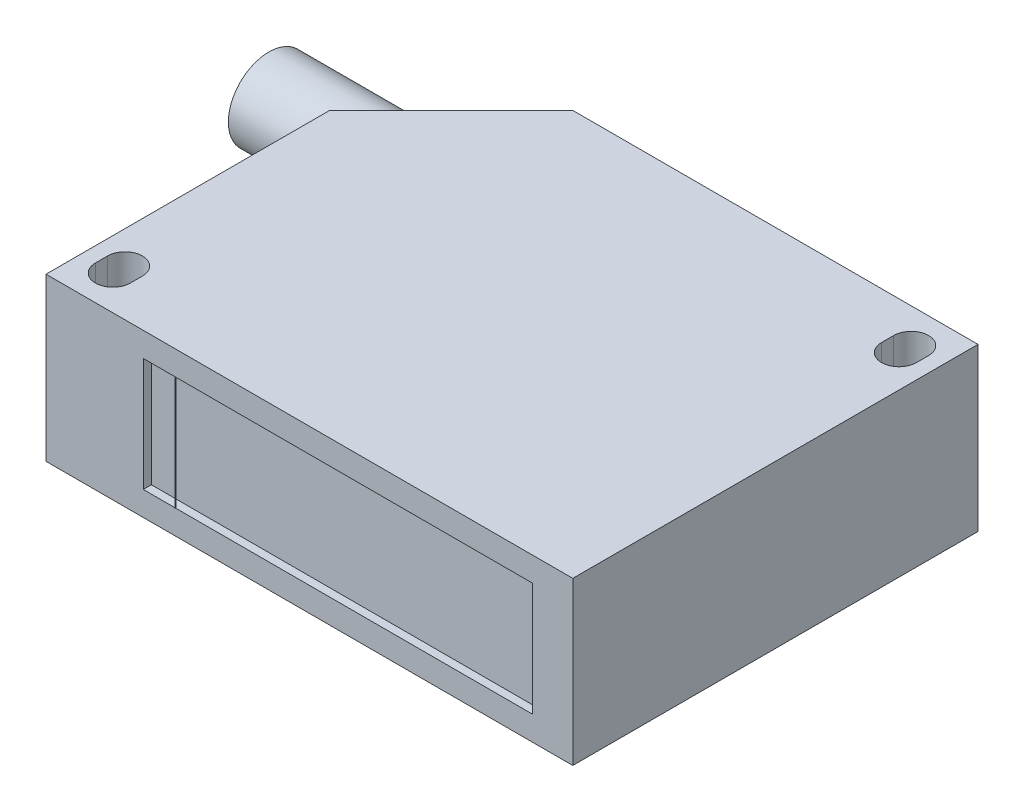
ISO-10303-21;
HEADER;
FILE_DESCRIPTION(('STEP AP214'),'2;1');
FILE_NAME('part.step','',(''),(''),'','','');
FILE_SCHEMA(('AUTOMOTIVE_DESIGN { 1 0 10303 214 1 1 1 1 }'));
ENDSEC;
DATA;
#1=APPLICATION_CONTEXT('core data for automotive mechanical design processes');
#2=APPLICATION_PROTOCOL_DEFINITION('international standard','automotive_design',2000,#1);
#3=PRODUCT_CONTEXT('',#1,'mechanical');
#4=PRODUCT('Part','Part','',(#3));
#5=PRODUCT_RELATED_PRODUCT_CATEGORY('part','',(#4));
#6=PRODUCT_DEFINITION_FORMATION('','',#4);
#7=PRODUCT_DEFINITION_CONTEXT('part definition',#1,'design');
#8=PRODUCT_DEFINITION('design','',#6,#7);
#9=PRODUCT_DEFINITION_SHAPE('','',#8);
#10=(LENGTH_UNIT() NAMED_UNIT(*) SI_UNIT(.MILLI.,.METRE.));
#11=(NAMED_UNIT(*) PLANE_ANGLE_UNIT() SI_UNIT($,.RADIAN.));
#12=(NAMED_UNIT(*) SI_UNIT($,.STERADIAN.) SOLID_ANGLE_UNIT());
#13=UNCERTAINTY_MEASURE_WITH_UNIT(LENGTH_MEASURE(1.E-05),#10,'distance_accuracy_value','');
#14=(GEOMETRIC_REPRESENTATION_CONTEXT(3) GLOBAL_UNCERTAINTY_ASSIGNED_CONTEXT((#13)) GLOBAL_UNIT_ASSIGNED_CONTEXT((#10,
#11,#12)) REPRESENTATION_CONTEXT('',''));
#15=CARTESIAN_POINT('',(0.,0.,0.));
#16=DIRECTION('',(0.,0.,1.));
#17=DIRECTION('',(1.,0.,0.));
#18=AXIS2_PLACEMENT_3D('',#15,#16,#17);
#19=CARTESIAN_POINT('',(-16.5,7.,25.1));
#20=DIRECTION('',(1.,0.,0.));
#21=DIRECTION('',(0.,0.,-1.));
#22=AXIS2_PLACEMENT_3D('',#19,#20,#21);
#23=PLANE('',#22);
#24=DIRECTION('',(0.,-1.,0.));
#25=VECTOR('',#24,1.);
#26=CARTESIAN_POINT('',(-16.5,7.,25.));
#27=LINE('',#26,#25);
#28=CARTESIAN_POINT('',(-16.5,7.,25.));
#29=VERTEX_POINT('',#28);
#30=CARTESIAN_POINT('',(-16.5,-7.,25.));
#31=VERTEX_POINT('',#30);
#32=EDGE_CURVE('E114',#29,#31,#27,.T.);
#33=ORIENTED_EDGE('',*,*,#32,.T.);
#34=DIRECTION('',(0.,0.,-1.));
#35=VECTOR('',#34,1.);
#36=CARTESIAN_POINT('',(-16.5,-7.,25.1));
#37=LINE('',#36,#35);
#38=CARTESIAN_POINT('',(-16.5,-7.,25.1));
#39=VERTEX_POINT('',#38);
#40=EDGE_CURVE('E12',#39,#31,#37,.T.);
#41=ORIENTED_EDGE('',*,*,#40,.F.);
#42=DIRECTION('',(0.,-1.,0.));
#43=VECTOR('',#42,1.);
#44=CARTESIAN_POINT('',(-16.5,7.,25.1));
#45=LINE('',#44,#43);
#46=CARTESIAN_POINT('',(-16.5,7.,25.1));
#47=VERTEX_POINT('',#46);
#48=EDGE_CURVE('E102',#47,#39,#45,.T.);
#49=ORIENTED_EDGE('',*,*,#48,.F.);
#50=DIRECTION('',(0.,0.,-1.));
#51=VECTOR('',#50,1.);
#52=CARTESIAN_POINT('',(-16.5,7.,25.1));
#53=LINE('',#52,#51);
#54=EDGE_CURVE('E110',#47,#29,#53,.T.);
#55=ORIENTED_EDGE('',*,*,#54,.T.);
#56=EDGE_LOOP('',(#33,#41,#49,#55));
#57=FACE_BOUND('',#56,.T.);
#58=ADVANCED_FACE('F51',(#57),#23,.F.);
#59=CARTESIAN_POINT('',(-16.5,-7.,25.1));
#60=DIRECTION('',(0.,1.,0.));
#61=DIRECTION('',(0.,0.,1.));
#62=AXIS2_PLACEMENT_3D('',#59,#60,#61);
#63=PLANE('',#62);
#64=DIRECTION('',(1.,0.,0.));
#65=VECTOR('',#64,1.);
#66=CARTESIAN_POINT('',(-16.5,-7.,25.));
#67=LINE('',#66,#65);
#68=CARTESIAN_POINT('',(-16.49,-7.,25.));
#69=VERTEX_POINT('',#68);
#70=EDGE_CURVE('E106',#31,#69,#67,.T.);
#71=ORIENTED_EDGE('',*,*,#70,.T.);
#72=DIRECTION('',(0.,0.,-1.));
#73=VECTOR('',#72,1.);
#74=CARTESIAN_POINT('',(-16.49,-7.,25.1));
#75=LINE('',#74,#73);
#76=CARTESIAN_POINT('',(-16.49,-7.,25.1));
#77=VERTEX_POINT('',#76);
#78=EDGE_CURVE('E59',#77,#69,#75,.T.);
#79=ORIENTED_EDGE('',*,*,#78,.F.);
#80=DIRECTION('',(1.,0.,0.));
#81=VECTOR('',#80,1.);
#82=CARTESIAN_POINT('',(-16.5,-7.,25.1));
#83=LINE('',#82,#81);
#84=EDGE_CURVE('E97',#39,#77,#83,.T.);
#85=ORIENTED_EDGE('',*,*,#84,.F.);
#86=ORIENTED_EDGE('',*,*,#40,.T.);
#87=EDGE_LOOP('',(#71,#79,#85,#86));
#88=FACE_BOUND('',#87,.T.);
#89=ADVANCED_FACE('F105',(#88),#63,.F.);
#90=CARTESIAN_POINT('',(-16.49,7.,25.1));
#91=DIRECTION('',(-1.,0.,0.));
#92=DIRECTION('',(0.,0.,1.));
#93=AXIS2_PLACEMENT_3D('',#90,#91,#92);
#94=PLANE('',#93);
#95=DIRECTION('',(0.,1.,0.));
#96=VECTOR('',#95,1.);
#97=CARTESIAN_POINT('',(-16.49,7.,25.));
#98=LINE('',#97,#96);
#99=CARTESIAN_POINT('',(-16.49,7.,25.));
#100=VERTEX_POINT('',#99);
#101=EDGE_CURVE('E84',#69,#100,#98,.T.);
#102=ORIENTED_EDGE('',*,*,#101,.T.);
#103=DIRECTION('',(0.,0.,-1.));
#104=VECTOR('',#103,1.);
#105=CARTESIAN_POINT('',(-16.49,7.,25.1));
#106=LINE('',#105,#104);
#107=CARTESIAN_POINT('',(-16.49,7.,25.1));
#108=VERTEX_POINT('',#107);
#109=EDGE_CURVE('E107',#108,#100,#106,.T.);
#110=ORIENTED_EDGE('',*,*,#109,.F.);
#111=DIRECTION('',(0.,1.,0.));
#112=VECTOR('',#111,1.);
#113=CARTESIAN_POINT('',(-16.49,7.,25.1));
#114=LINE('',#113,#112);
#115=EDGE_CURVE('E100',#77,#108,#114,.T.);
#116=ORIENTED_EDGE('',*,*,#115,.F.);
#117=ORIENTED_EDGE('',*,*,#78,.T.);
#118=EDGE_LOOP('',(#102,#110,#116,#117));
#119=FACE_BOUND('',#118,.T.);
#120=ADVANCED_FACE('F108',(#119),#94,.F.);
#121=CARTESIAN_POINT('',(-16.5,7.,25.1));
#122=DIRECTION('',(0.,-1.,0.));
#123=DIRECTION('',(0.,0.,-1.));
#124=AXIS2_PLACEMENT_3D('',#121,#122,#123);
#125=PLANE('',#124);
#126=DIRECTION('',(-1.,0.,0.));
#127=VECTOR('',#126,1.);
#128=CARTESIAN_POINT('',(-16.5,7.,25.));
#129=LINE('',#128,#127);
#130=EDGE_CURVE('E90',#100,#29,#129,.T.);
#131=ORIENTED_EDGE('',*,*,#130,.T.);
#132=ORIENTED_EDGE('',*,*,#54,.F.);
#133=DIRECTION('',(-1.,0.,0.));
#134=VECTOR('',#133,1.);
#135=CARTESIAN_POINT('',(-16.5,7.,25.1));
#136=LINE('',#135,#134);
#137=EDGE_CURVE('E67',#108,#47,#136,.T.);
#138=ORIENTED_EDGE('',*,*,#137,.F.);
#139=ORIENTED_EDGE('',*,*,#109,.T.);
#140=EDGE_LOOP('',(#131,#132,#138,#139));
#141=FACE_BOUND('',#140,.T.);
#142=ADVANCED_FACE('F121',(#141),#125,.F.);
#143=CARTESIAN_POINT('',(0.,0.,25.1));
#144=DIRECTION('',(0.,0.,1.));
#145=DIRECTION('',(1.,0.,0.));
#146=AXIS2_PLACEMENT_3D('',#143,#144,#145);
#147=PLANE('',#146);
#148=ORIENTED_EDGE('',*,*,#48,.T.);
#149=ORIENTED_EDGE('',*,*,#84,.T.);
#150=ORIENTED_EDGE('',*,*,#115,.T.);
#151=ORIENTED_EDGE('',*,*,#137,.T.);
#152=EDGE_LOOP('',(#148,#149,#150,#151));
#153=FACE_BOUND('',#152,.T.);
#154=ADVANCED_FACE('F98',(#153),#147,.T.);
#155=CARTESIAN_POINT('',(0.,0.,25.));
#156=DIRECTION('',(0.,0.,1.));
#157=DIRECTION('',(1.,0.,0.));
#158=AXIS2_PLACEMENT_3D('',#155,#156,#157);
#159=PLANE('',#158);
#160=ORIENTED_EDGE('',*,*,#32,.F.);
#161=ORIENTED_EDGE('',*,*,#130,.F.);
#162=ORIENTED_EDGE('',*,*,#101,.F.);
#163=ORIENTED_EDGE('',*,*,#70,.F.);
#164=EDGE_LOOP('',(#160,#161,#162,#163));
#165=FACE_BOUND('',#164,.T.);
#166=ADVANCED_FACE('F124',(#165),#159,.F.);
#167=CLOSED_SHELL('',(#58,#89,#120,#142,#154,#166));
#168=MANIFOLD_SOLID_BREP('B2',#167);
#169=CARTESIAN_POINT('',(32.5,10.,-25.));
#170=DIRECTION('',(-1.,0.,0.));
#171=DIRECTION('',(0.,0.,1.));
#172=AXIS2_PLACEMENT_3D('',#169,#170,#171);
#173=PLANE('',#172);
#174=DIRECTION('',(0.,0.,-1.));
#175=VECTOR('',#174,1.);
#176=CARTESIAN_POINT('',(32.5,-10.,-25.));
#177=LINE('',#176,#175);
#178=CARTESIAN_POINT('',(32.5,-10.,25.));
#179=VERTEX_POINT('',#178);
#180=CARTESIAN_POINT('',(32.5,-10.,-25.));
#181=VERTEX_POINT('',#180);
#182=EDGE_CURVE('E338',#179,#181,#177,.T.);
#183=ORIENTED_EDGE('',*,*,#182,.T.);
#184=DIRECTION('',(0.,-1.,0.));
#185=VECTOR('',#184,1.);
#186=CARTESIAN_POINT('',(32.5,10.,-25.));
#187=LINE('',#186,#185);
#188=CARTESIAN_POINT('',(32.5,10.,-25.));
#189=VERTEX_POINT('',#188);
#190=EDGE_CURVE('E192',#189,#181,#187,.T.);
#191=ORIENTED_EDGE('',*,*,#190,.F.);
#192=DIRECTION('',(0.,0.,-1.));
#193=VECTOR('',#192,1.);
#194=CARTESIAN_POINT('',(32.5,10.,-25.));
#195=LINE('',#194,#193);
#196=CARTESIAN_POINT('',(32.5,10.,25.));
#197=VERTEX_POINT('',#196);
#198=EDGE_CURVE('E326',#197,#189,#195,.T.);
#199=ORIENTED_EDGE('',*,*,#198,.F.);
#200=DIRECTION('',(0.,-1.,0.));
#201=VECTOR('',#200,1.);
#202=CARTESIAN_POINT('',(32.5,10.,25.));
#203=LINE('',#202,#201);
#204=EDGE_CURVE('E337',#197,#179,#203,.T.);
#205=ORIENTED_EDGE('',*,*,#204,.T.);
#206=EDGE_LOOP('',(#183,#191,#199,#205));
#207=FACE_BOUND('',#206,.T.);
#208=ADVANCED_FACE('F189',(#207),#173,.F.);
#209=CARTESIAN_POINT('',(-32.5,10.,-25.));
#210=DIRECTION('',(0.,0.,1.));
#211=DIRECTION('',(1.,0.,0.));
#212=AXIS2_PLACEMENT_3D('',#209,#210,#211);
#213=PLANE('',#212);
#214=DIRECTION('',(-1.,0.,0.));
#215=VECTOR('',#214,1.);
#216=CARTESIAN_POINT('',(-32.5,-10.,-25.));
#217=LINE('',#216,#215);
#218=CARTESIAN_POINT('',(-17.5,-10.,-25.));
#219=VERTEX_POINT('',#218);
#220=EDGE_CURVE('E321',#181,#219,#217,.T.);
#221=ORIENTED_EDGE('',*,*,#220,.T.);
#222=DIRECTION('',(0.,-1.,0.));
#223=VECTOR('',#222,1.);
#224=CARTESIAN_POINT('',(-17.5,10.,-25.));
#225=LINE('',#224,#223);
#226=CARTESIAN_POINT('',(-17.5,10.,-25.));
#227=VERTEX_POINT('',#226);
#228=EDGE_CURVE('E204',#227,#219,#225,.T.);
#229=ORIENTED_EDGE('',*,*,#228,.F.);
#230=DIRECTION('',(-1.,0.,0.));
#231=VECTOR('',#230,1.);
#232=CARTESIAN_POINT('',(-32.5,10.,-25.));
#233=LINE('',#232,#231);
#234=EDGE_CURVE('E319',#189,#227,#233,.T.);
#235=ORIENTED_EDGE('',*,*,#234,.F.);
#236=ORIENTED_EDGE('',*,*,#190,.T.);
#237=EDGE_LOOP('',(#221,#229,#235,#236));
#238=FACE_BOUND('',#237,.T.);
#239=ADVANCED_FACE('F317',(#238),#213,.F.);
#240=CARTESIAN_POINT('',(-32.5,10.,-25.));
#241=DIRECTION('',(1.,0.,0.));
#242=DIRECTION('',(0.,0.,-1.));
#243=AXIS2_PLACEMENT_3D('',#240,#241,#242);
#244=PLANE('',#243);
#245=DIRECTION('',(0.,0.,1.));
#246=VECTOR('',#245,1.);
#247=CARTESIAN_POINT('',(-32.5,10.,-25.));
#248=LINE('',#247,#246);
#249=CARTESIAN_POINT('',(-32.5,10.,-10.));
#250=VERTEX_POINT('',#249);
#251=CARTESIAN_POINT('',(-32.5,10.,25.));
#252=VERTEX_POINT('',#251);
#253=EDGE_CURVE('E328',#250,#252,#248,.T.);
#254=ORIENTED_EDGE('',*,*,#253,.F.);
#255=DIRECTION('',(0.,-1.,0.));
#256=VECTOR('',#255,1.);
#257=CARTESIAN_POINT('',(-32.5,10.,-10.));
#258=LINE('',#257,#256);
#259=CARTESIAN_POINT('',(-32.5,-10.,-10.));
#260=VERTEX_POINT('',#259);
#261=EDGE_CURVE('E309',#250,#260,#258,.T.);
#262=ORIENTED_EDGE('',*,*,#261,.T.);
#263=DIRECTION('',(0.,0.,1.));
#264=VECTOR('',#263,1.);
#265=CARTESIAN_POINT('',(-32.5,-10.,-25.));
#266=LINE('',#265,#264);
#267=CARTESIAN_POINT('',(-32.5,-10.,25.));
#268=VERTEX_POINT('',#267);
#269=EDGE_CURVE('E343',#260,#268,#266,.T.);
#270=ORIENTED_EDGE('',*,*,#269,.T.);
#271=DIRECTION('',(0.,-1.,0.));
#272=VECTOR('',#271,1.);
#273=CARTESIAN_POINT('',(-32.5,10.,25.));
#274=LINE('',#273,#272);
#275=EDGE_CURVE('E347',#252,#268,#274,.T.);
#276=ORIENTED_EDGE('',*,*,#275,.F.);
#277=EDGE_LOOP('',(#254,#262,#270,#276));
#278=FACE_BOUND('',#277,.T.);
#279=ADVANCED_FACE('F489',(#278),#244,.F.);
#280=CARTESIAN_POINT('',(-32.5,10.,25.));
#281=DIRECTION('',(0.,0.,-1.));
#282=DIRECTION('',(-1.,0.,0.));
#283=AXIS2_PLACEMENT_3D('',#280,#281,#282);
#284=PLANE('',#283);
#285=DIRECTION('',(-1.,0.,0.));
#286=VECTOR('',#285,1.);
#287=CARTESIAN_POINT('',(-20.5,7.,25.));
#288=LINE('',#287,#286);
#289=CARTESIAN_POINT('',(27.5,7.,25.));
#290=VERTEX_POINT('',#289);
#291=CARTESIAN_POINT('',(-20.5,7.,25.));
#292=VERTEX_POINT('',#291);
#293=EDGE_CURVE('E443',#290,#292,#288,.T.);
#294=ORIENTED_EDGE('',*,*,#293,.F.);
#295=DIRECTION('',(0.,1.,0.));
#296=VECTOR('',#295,1.);
#297=CARTESIAN_POINT('',(27.5,7.,25.));
#298=LINE('',#297,#296);
#299=CARTESIAN_POINT('',(27.5,-7.,25.));
#300=VERTEX_POINT('',#299);
#301=EDGE_CURVE('E391',#300,#290,#298,.T.);
#302=ORIENTED_EDGE('',*,*,#301,.F.);
#303=DIRECTION('',(1.,0.,0.));
#304=VECTOR('',#303,1.);
#305=CARTESIAN_POINT('',(-20.5,-7.,25.));
#306=LINE('',#305,#304);
#307=CARTESIAN_POINT('',(-20.5,-7.,25.));
#308=VERTEX_POINT('',#307);
#309=EDGE_CURVE('E432',#308,#300,#306,.T.);
#310=ORIENTED_EDGE('',*,*,#309,.F.);
#311=DIRECTION('',(0.,-1.,0.));
#312=VECTOR('',#311,1.);
#313=CARTESIAN_POINT('',(-20.5,7.,25.));
#314=LINE('',#313,#312);
#315=EDGE_CURVE('E445',#292,#308,#314,.T.);
#316=ORIENTED_EDGE('',*,*,#315,.F.);
#317=EDGE_LOOP('',(#294,#302,#310,#316));
#318=FACE_BOUND('',#317,.T.);
#319=DIRECTION('',(1.,0.,0.));
#320=VECTOR('',#319,1.);
#321=CARTESIAN_POINT('',(-32.5,-10.,25.));
#322=LINE('',#321,#320);
#323=EDGE_CURVE('E332',#268,#179,#322,.T.);
#324=ORIENTED_EDGE('',*,*,#323,.T.);
#325=ORIENTED_EDGE('',*,*,#204,.F.);
#326=DIRECTION('',(1.,0.,0.));
#327=VECTOR('',#326,1.);
#328=CARTESIAN_POINT('',(-32.5,10.,25.));
#329=LINE('',#328,#327);
#330=EDGE_CURVE('E330',#252,#197,#329,.T.);
#331=ORIENTED_EDGE('',*,*,#330,.F.);
#332=ORIENTED_EDGE('',*,*,#275,.T.);
#333=EDGE_LOOP('',(#324,#325,#331,#332));
#334=FACE_BOUND('',#333,.T.);
#335=ADVANCED_FACE('F465',(#318,#334),#284,.F.);
#336=CARTESIAN_POINT('',(0.,10.,0.));
#337=DIRECTION('',(0.,1.,0.));
#338=DIRECTION('',(0.,0.,1.));
#339=AXIS2_PLACEMENT_3D('',#336,#337,#338);
#340=PLANE('',#339);
#341=DIRECTION('',(-0.707106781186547,0.,0.707106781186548));
#342=VECTOR('',#341,1.);
#343=CARTESIAN_POINT('',(-32.5,10.,-10.));
#344=LINE('',#343,#342);
#345=EDGE_CURVE('E306',#227,#250,#344,.T.);
#346=ORIENTED_EDGE('',*,*,#345,.T.);
#347=ORIENTED_EDGE('',*,*,#253,.T.);
#348=ORIENTED_EDGE('',*,*,#330,.T.);
#349=ORIENTED_EDGE('',*,*,#198,.T.);
#350=ORIENTED_EDGE('',*,*,#234,.T.);
#351=EDGE_LOOP('',(#346,#347,#348,#349,#350));
#352=FACE_BOUND('',#351,.T.);
#353=CARTESIAN_POINT('',(-28.5,10.,19.25));
#354=DIRECTION('',(0.,-1.,0.));
#355=DIRECTION('',(0.,0.,-1.));
#356=AXIS2_PLACEMENT_3D('',#353,#354,#355);
#357=CIRCLE('',#356,2.15);
#358=CARTESIAN_POINT('',(-30.65,10.,19.25));
#359=VERTEX_POINT('',#358);
#360=CARTESIAN_POINT('',(-26.35,10.,19.25));
#361=VERTEX_POINT('',#360);
#362=EDGE_CURVE('E366',#359,#361,#357,.T.);
#363=ORIENTED_EDGE('',*,*,#362,.T.);
#364=DIRECTION('',(0.,0.,1.));
#365=VECTOR('',#364,1.);
#366=CARTESIAN_POINT('',(-26.35,10.,19.25));
#367=LINE('',#366,#365);
#368=CARTESIAN_POINT('',(-26.35,10.,20.75));
#369=VERTEX_POINT('',#368);
#370=EDGE_CURVE('E369',#361,#369,#367,.T.);
#371=ORIENTED_EDGE('',*,*,#370,.T.);
#372=CARTESIAN_POINT('',(-28.5,10.,20.75));
#373=DIRECTION('',(0.,-1.,0.));
#374=DIRECTION('',(0.,0.,-1.));
#375=AXIS2_PLACEMENT_3D('',#372,#373,#374);
#376=CIRCLE('',#375,2.15);
#377=CARTESIAN_POINT('',(-30.65,10.,20.75));
#378=VERTEX_POINT('',#377);
#379=EDGE_CURVE('E212',#369,#378,#376,.T.);
#380=ORIENTED_EDGE('',*,*,#379,.T.);
#381=DIRECTION('',(0.,0.,-1.));
#382=VECTOR('',#381,1.);
#383=CARTESIAN_POINT('',(-30.65,10.,19.25));
#384=LINE('',#383,#382);
#385=EDGE_CURVE('E374',#378,#359,#384,.T.);
#386=ORIENTED_EDGE('',*,*,#385,.T.);
#387=EDGE_LOOP('',(#363,#371,#380,#386));
#388=FACE_BOUND('',#387,.T.);
#389=CARTESIAN_POINT('',(28.5,10.,-20.75));
#390=DIRECTION('',(0.,-1.,0.));
#391=DIRECTION('',(0.,0.,-1.));
#392=AXIS2_PLACEMENT_3D('',#389,#390,#391);
#393=CIRCLE('',#392,2.15);
#394=CARTESIAN_POINT('',(26.35,10.,-20.75));
#395=VERTEX_POINT('',#394);
#396=CARTESIAN_POINT('',(30.65,10.,-20.75));
#397=VERTEX_POINT('',#396);
#398=EDGE_CURVE('E398',#395,#397,#393,.T.);
#399=ORIENTED_EDGE('',*,*,#398,.T.);
#400=DIRECTION('',(0.,0.,1.));
#401=VECTOR('',#400,1.);
#402=CARTESIAN_POINT('',(30.65,10.,-20.75));
#403=LINE('',#402,#401);
#404=CARTESIAN_POINT('',(30.65,10.,-19.25));
#405=VERTEX_POINT('',#404);
#406=EDGE_CURVE('E401',#397,#405,#403,.T.);
#407=ORIENTED_EDGE('',*,*,#406,.T.);
#408=CARTESIAN_POINT('',(28.5,10.,-19.25));
#409=DIRECTION('',(0.,-1.,0.));
#410=DIRECTION('',(0.,0.,-1.));
#411=AXIS2_PLACEMENT_3D('',#408,#409,#410);
#412=CIRCLE('',#411,2.15);
#413=CARTESIAN_POINT('',(26.35,10.,-19.25));
#414=VERTEX_POINT('',#413);
#415=EDGE_CURVE('E405',#405,#414,#412,.T.);
#416=ORIENTED_EDGE('',*,*,#415,.T.);
#417=DIRECTION('',(0.,0.,-1.));
#418=VECTOR('',#417,1.);
#419=CARTESIAN_POINT('',(26.35,10.,-20.75));
#420=LINE('',#419,#418);
#421=EDGE_CURVE('E408',#414,#395,#420,.T.);
#422=ORIENTED_EDGE('',*,*,#421,.T.);
#423=EDGE_LOOP('',(#399,#407,#416,#422));
#424=FACE_BOUND('',#423,.T.);
#425=ADVANCED_FACE('F323',(#352,#388,#424),#340,.T.);
#426=CARTESIAN_POINT('',(0.,-10.,0.));
#427=DIRECTION('',(0.,1.,0.));
#428=DIRECTION('',(0.,0.,1.));
#429=AXIS2_PLACEMENT_3D('',#426,#427,#428);
#430=PLANE('',#429);
#431=DIRECTION('',(0.,0.,1.));
#432=VECTOR('',#431,1.);
#433=CARTESIAN_POINT('',(-26.35,-10.,19.25));
#434=LINE('',#433,#432);
#435=CARTESIAN_POINT('',(-26.35,-10.,19.25));
#436=VERTEX_POINT('',#435);
#437=CARTESIAN_POINT('',(-26.35,-10.,20.75));
#438=VERTEX_POINT('',#437);
#439=EDGE_CURVE('E380',#436,#438,#434,.T.);
#440=ORIENTED_EDGE('',*,*,#439,.F.);
#441=CARTESIAN_POINT('',(-28.5,-10.,19.25));
#442=DIRECTION('',(0.,-1.,0.));
#443=DIRECTION('',(0.,0.,-1.));
#444=AXIS2_PLACEMENT_3D('',#441,#442,#443);
#445=CIRCLE('',#444,2.15);
#446=CARTESIAN_POINT('',(-30.65,-10.,19.25));
#447=VERTEX_POINT('',#446);
#448=EDGE_CURVE('E378',#447,#436,#445,.T.);
#449=ORIENTED_EDGE('',*,*,#448,.F.);
#450=DIRECTION('',(0.,0.,-1.));
#451=VECTOR('',#450,1.);
#452=CARTESIAN_POINT('',(-30.65,-10.,19.25));
#453=LINE('',#452,#451);
#454=CARTESIAN_POINT('',(-30.65,-10.,20.75));
#455=VERTEX_POINT('',#454);
#456=EDGE_CURVE('E370',#455,#447,#453,.T.);
#457=ORIENTED_EDGE('',*,*,#456,.F.);
#458=CARTESIAN_POINT('',(-28.5,-10.,20.75));
#459=DIRECTION('',(0.,-1.,0.));
#460=DIRECTION('',(0.,0.,-1.));
#461=AXIS2_PLACEMENT_3D('',#458,#459,#460);
#462=CIRCLE('',#461,2.15);
#463=EDGE_CURVE('E384',#438,#455,#462,.T.);
#464=ORIENTED_EDGE('',*,*,#463,.F.);
#465=EDGE_LOOP('',(#440,#449,#457,#464));
#466=FACE_BOUND('',#465,.T.);
#467=DIRECTION('',(0.,0.,1.));
#468=VECTOR('',#467,1.);
#469=CARTESIAN_POINT('',(30.65,-10.,-20.75));
#470=LINE('',#469,#468);
#471=CARTESIAN_POINT('',(30.65,-10.,-20.75));
#472=VERTEX_POINT('',#471);
#473=CARTESIAN_POINT('',(30.65,-10.,-19.25));
#474=VERTEX_POINT('',#473);
#475=EDGE_CURVE('E413',#472,#474,#470,.T.);
#476=ORIENTED_EDGE('',*,*,#475,.F.);
#477=CARTESIAN_POINT('',(28.5,-10.,-20.75));
#478=DIRECTION('',(0.,-1.,0.));
#479=DIRECTION('',(0.,0.,-1.));
#480=AXIS2_PLACEMENT_3D('',#477,#478,#479);
#481=CIRCLE('',#480,2.15);
#482=CARTESIAN_POINT('',(26.35,-10.,-20.75));
#483=VERTEX_POINT('',#482);
#484=EDGE_CURVE('E364',#483,#472,#481,.T.);
#485=ORIENTED_EDGE('',*,*,#484,.F.);
#486=DIRECTION('',(0.,0.,-1.));
#487=VECTOR('',#486,1.);
#488=CARTESIAN_POINT('',(26.35,-10.,-20.75));
#489=LINE('',#488,#487);
#490=CARTESIAN_POINT('',(26.35,-10.,-19.25));
#491=VERTEX_POINT('',#490);
#492=EDGE_CURVE('E402',#491,#483,#489,.T.);
#493=ORIENTED_EDGE('',*,*,#492,.F.);
#494=CARTESIAN_POINT('',(28.5,-10.,-19.25));
#495=DIRECTION('',(0.,-1.,0.));
#496=DIRECTION('',(0.,0.,-1.));
#497=AXIS2_PLACEMENT_3D('',#494,#495,#496);
#498=CIRCLE('',#497,2.15);
#499=EDGE_CURVE('E416',#474,#491,#498,.T.);
#500=ORIENTED_EDGE('',*,*,#499,.F.);
#501=EDGE_LOOP('',(#476,#485,#493,#500));
#502=FACE_BOUND('',#501,.T.);
#503=ORIENTED_EDGE('',*,*,#269,.F.);
#504=DIRECTION('',(-0.707106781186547,0.,0.707106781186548));
#505=VECTOR('',#504,1.);
#506=CARTESIAN_POINT('',(-32.5,-10.,-10.));
#507=LINE('',#506,#505);
#508=EDGE_CURVE('E313',#219,#260,#507,.T.);
#509=ORIENTED_EDGE('',*,*,#508,.F.);
#510=ORIENTED_EDGE('',*,*,#220,.F.);
#511=ORIENTED_EDGE('',*,*,#182,.F.);
#512=ORIENTED_EDGE('',*,*,#323,.F.);
#513=EDGE_LOOP('',(#503,#509,#510,#511,#512));
#514=FACE_BOUND('',#513,.T.);
#515=ADVANCED_FACE('F358',(#466,#502,#514),#430,.F.);
#516=CARTESIAN_POINT('',(27.5,7.,24.));
#517=DIRECTION('',(1.,0.,0.));
#518=DIRECTION('',(0.,1.,0.));
#519=AXIS2_PLACEMENT_3D('',#516,#517,#518);
#520=PLANE('',#519);
#521=ORIENTED_EDGE('',*,*,#301,.T.);
#522=DIRECTION('',(0.,0.,1.));
#523=VECTOR('',#522,1.);
#524=CARTESIAN_POINT('',(27.5,7.,24.));
#525=LINE('',#524,#523);
#526=CARTESIAN_POINT('',(27.5,7.,24.));
#527=VERTEX_POINT('',#526);
#528=EDGE_CURVE('E441',#527,#290,#525,.T.);
#529=ORIENTED_EDGE('',*,*,#528,.F.);
#530=DIRECTION('',(0.,1.,0.));
#531=VECTOR('',#530,1.);
#532=CARTESIAN_POINT('',(27.5,7.,24.));
#533=LINE('',#532,#531);
#534=CARTESIAN_POINT('',(27.5,-7.,24.));
#535=VERTEX_POINT('',#534);
#536=EDGE_CURVE('E428',#535,#527,#533,.T.);
#537=ORIENTED_EDGE('',*,*,#536,.F.);
#538=DIRECTION('',(0.,0.,1.));
#539=VECTOR('',#538,1.);
#540=CARTESIAN_POINT('',(27.5,-7.,24.));
#541=LINE('',#540,#539);
#542=EDGE_CURVE('E341',#535,#300,#541,.T.);
#543=ORIENTED_EDGE('',*,*,#542,.T.);
#544=EDGE_LOOP('',(#521,#529,#537,#543));
#545=FACE_BOUND('',#544,.T.);
#546=ADVANCED_FACE('F473',(#545),#520,.F.);
#547=CARTESIAN_POINT('',(-20.5,-7.,24.));
#548=DIRECTION('',(0.,-1.,0.));
#549=DIRECTION('',(1.,0.,0.));
#550=AXIS2_PLACEMENT_3D('',#547,#548,#549);
#551=PLANE('',#550);
#552=ORIENTED_EDGE('',*,*,#309,.T.);
#553=ORIENTED_EDGE('',*,*,#542,.F.);
#554=DIRECTION('',(1.,0.,0.));
#555=VECTOR('',#554,1.);
#556=CARTESIAN_POINT('',(-20.5,-7.,24.));
#557=LINE('',#556,#555);
#558=CARTESIAN_POINT('',(-20.5,-7.,24.));
#559=VERTEX_POINT('',#558);
#560=EDGE_CURVE('E438',#559,#535,#557,.T.);
#561=ORIENTED_EDGE('',*,*,#560,.F.);
#562=DIRECTION('',(0.,0.,1.));
#563=VECTOR('',#562,1.);
#564=CARTESIAN_POINT('',(-20.5,-7.,24.));
#565=LINE('',#564,#563);
#566=EDGE_CURVE('E451',#559,#308,#565,.T.);
#567=ORIENTED_EDGE('',*,*,#566,.T.);
#568=EDGE_LOOP('',(#552,#553,#561,#567));
#569=FACE_BOUND('',#568,.T.);
#570=ADVANCED_FACE('F475',(#569),#551,.F.);
#571=CARTESIAN_POINT('',(-20.5,7.,24.));
#572=DIRECTION('',(-1.,0.,0.));
#573=DIRECTION('',(0.,0.,1.));
#574=AXIS2_PLACEMENT_3D('',#571,#572,#573);
#575=PLANE('',#574);
#576=ORIENTED_EDGE('',*,*,#315,.T.);
#577=ORIENTED_EDGE('',*,*,#566,.F.);
#578=DIRECTION('',(0.,-1.,0.));
#579=VECTOR('',#578,1.);
#580=CARTESIAN_POINT('',(-20.5,7.,24.));
#581=LINE('',#580,#579);
#582=CARTESIAN_POINT('',(-20.5,7.,24.));
#583=VERTEX_POINT('',#582);
#584=EDGE_CURVE('E435',#583,#559,#581,.T.);
#585=ORIENTED_EDGE('',*,*,#584,.F.);
#586=DIRECTION('',(0.,0.,1.));
#587=VECTOR('',#586,1.);
#588=CARTESIAN_POINT('',(-20.5,7.,24.));
#589=LINE('',#588,#587);
#590=EDGE_CURVE('E453',#583,#292,#589,.T.);
#591=ORIENTED_EDGE('',*,*,#590,.T.);
#592=EDGE_LOOP('',(#576,#577,#585,#591));
#593=FACE_BOUND('',#592,.T.);
#594=ADVANCED_FACE('F468',(#593),#575,.F.);
#595=CARTESIAN_POINT('',(-20.5,7.,24.));
#596=DIRECTION('',(0.,1.,0.));
#597=DIRECTION('',(0.,0.,1.));
#598=AXIS2_PLACEMENT_3D('',#595,#596,#597);
#599=PLANE('',#598);
#600=ORIENTED_EDGE('',*,*,#293,.T.);
#601=ORIENTED_EDGE('',*,*,#590,.F.);
#602=DIRECTION('',(-1.,0.,0.));
#603=VECTOR('',#602,1.);
#604=CARTESIAN_POINT('',(-20.5,7.,24.));
#605=LINE('',#604,#603);
#606=EDGE_CURVE('E431',#527,#583,#605,.T.);
#607=ORIENTED_EDGE('',*,*,#606,.F.);
#608=ORIENTED_EDGE('',*,*,#528,.T.);
#609=EDGE_LOOP('',(#600,#601,#607,#608));
#610=FACE_BOUND('',#609,.T.);
#611=ADVANCED_FACE('F459',(#610),#599,.F.);
#612=CARTESIAN_POINT('',(0.,0.,24.));
#613=DIRECTION('',(0.,0.,1.));
#614=DIRECTION('',(1.,0.,0.));
#615=AXIS2_PLACEMENT_3D('',#612,#613,#614);
#616=PLANE('',#615);
#617=ORIENTED_EDGE('',*,*,#536,.T.);
#618=ORIENTED_EDGE('',*,*,#606,.T.);
#619=ORIENTED_EDGE('',*,*,#584,.T.);
#620=ORIENTED_EDGE('',*,*,#560,.T.);
#621=EDGE_LOOP('',(#617,#618,#619,#620));
#622=FACE_BOUND('',#621,.T.);
#623=ADVANCED_FACE('F472',(#622),#616,.T.);
#624=CARTESIAN_POINT('',(28.5,10.,-20.75));
#625=DIRECTION('',(0.,-1.,0.));
#626=DIRECTION('',(0.,0.,-1.));
#627=AXIS2_PLACEMENT_3D('',#624,#625,#626);
#628=CYLINDRICAL_SURFACE('',#627,2.15);
#629=ORIENTED_EDGE('',*,*,#484,.T.);
#630=DIRECTION('',(0.,-1.,0.));
#631=VECTOR('',#630,1.);
#632=CARTESIAN_POINT('',(30.65,10.,-20.75));
#633=LINE('',#632,#631);
#634=EDGE_CURVE('E411',#397,#472,#633,.T.);
#635=ORIENTED_EDGE('',*,*,#634,.F.);
#636=ORIENTED_EDGE('',*,*,#398,.F.);
#637=DIRECTION('',(0.,-1.,0.));
#638=VECTOR('',#637,1.);
#639=CARTESIAN_POINT('',(26.35,10.,-20.75));
#640=LINE('',#639,#638);
#641=EDGE_CURVE('E381',#395,#483,#640,.T.);
#642=ORIENTED_EDGE('',*,*,#641,.T.);
#643=EDGE_LOOP('',(#629,#635,#636,#642));
#644=FACE_BOUND('',#643,.T.);
#645=ADVANCED_FACE('F507',(#644),#628,.F.);
#646=CARTESIAN_POINT('',(26.35,10.,-20.75));
#647=DIRECTION('',(-1.,0.,0.));
#648=DIRECTION('',(0.,0.,1.));
#649=AXIS2_PLACEMENT_3D('',#646,#647,#648);
#650=PLANE('',#649);
#651=ORIENTED_EDGE('',*,*,#492,.T.);
#652=ORIENTED_EDGE('',*,*,#641,.F.);
#653=ORIENTED_EDGE('',*,*,#421,.F.);
#654=DIRECTION('',(0.,-1.,0.));
#655=VECTOR('',#654,1.);
#656=CARTESIAN_POINT('',(26.35,10.,-19.25));
#657=LINE('',#656,#655);
#658=EDGE_CURVE('E422',#414,#491,#657,.T.);
#659=ORIENTED_EDGE('',*,*,#658,.T.);
#660=EDGE_LOOP('',(#651,#652,#653,#659));
#661=FACE_BOUND('',#660,.T.);
#662=ADVANCED_FACE('F511',(#661),#650,.F.);
#663=CARTESIAN_POINT('',(28.5,10.,-19.25));
#664=DIRECTION('',(0.,-1.,0.));
#665=DIRECTION('',(0.,0.,-1.));
#666=AXIS2_PLACEMENT_3D('',#663,#664,#665);
#667=CYLINDRICAL_SURFACE('',#666,2.15);
#668=ORIENTED_EDGE('',*,*,#499,.T.);
#669=ORIENTED_EDGE('',*,*,#658,.F.);
#670=ORIENTED_EDGE('',*,*,#415,.F.);
#671=DIRECTION('',(0.,-1.,0.));
#672=VECTOR('',#671,1.);
#673=CARTESIAN_POINT('',(30.65,10.,-19.25));
#674=LINE('',#673,#672);
#675=EDGE_CURVE('E424',#405,#474,#674,.T.);
#676=ORIENTED_EDGE('',*,*,#675,.T.);
#677=EDGE_LOOP('',(#668,#669,#670,#676));
#678=FACE_BOUND('',#677,.T.);
#679=ADVANCED_FACE('F519',(#678),#667,.F.);
#680=CARTESIAN_POINT('',(30.65,10.,-20.75));
#681=DIRECTION('',(1.,0.,0.));
#682=DIRECTION('',(0.,0.,-1.));
#683=AXIS2_PLACEMENT_3D('',#680,#681,#682);
#684=PLANE('',#683);
#685=ORIENTED_EDGE('',*,*,#475,.T.);
#686=ORIENTED_EDGE('',*,*,#675,.F.);
#687=ORIENTED_EDGE('',*,*,#406,.F.);
#688=ORIENTED_EDGE('',*,*,#634,.T.);
#689=EDGE_LOOP('',(#685,#686,#687,#688));
#690=FACE_BOUND('',#689,.T.);
#691=ADVANCED_FACE('F515',(#690),#684,.F.);
#692=CARTESIAN_POINT('',(-28.5,10.,19.25));
#693=DIRECTION('',(0.,-1.,0.));
#694=DIRECTION('',(0.,0.,-1.));
#695=AXIS2_PLACEMENT_3D('',#692,#693,#694);
#696=CYLINDRICAL_SURFACE('',#695,2.15);
#697=ORIENTED_EDGE('',*,*,#448,.T.);
#698=DIRECTION('',(0.,-1.,0.));
#699=VECTOR('',#698,1.);
#700=CARTESIAN_POINT('',(-26.35,10.,19.25));
#701=LINE('',#700,#699);
#702=EDGE_CURVE('E377',#361,#436,#701,.T.);
#703=ORIENTED_EDGE('',*,*,#702,.F.);
#704=ORIENTED_EDGE('',*,*,#362,.F.);
#705=DIRECTION('',(0.,-1.,0.));
#706=VECTOR('',#705,1.);
#707=CARTESIAN_POINT('',(-30.65,10.,19.25));
#708=LINE('',#707,#706);
#709=EDGE_CURVE('E389',#359,#447,#708,.T.);
#710=ORIENTED_EDGE('',*,*,#709,.T.);
#711=EDGE_LOOP('',(#697,#703,#704,#710));
#712=FACE_BOUND('',#711,.T.);
#713=ADVANCED_FACE('F518',(#712),#696,.F.);
#714=CARTESIAN_POINT('',(-30.65,10.,19.25));
#715=DIRECTION('',(-1.,0.,0.));
#716=DIRECTION('',(0.,0.,1.));
#717=AXIS2_PLACEMENT_3D('',#714,#715,#716);
#718=PLANE('',#717);
#719=ORIENTED_EDGE('',*,*,#456,.T.);
#720=ORIENTED_EDGE('',*,*,#709,.F.);
#721=ORIENTED_EDGE('',*,*,#385,.F.);
#722=DIRECTION('',(0.,-1.,0.));
#723=VECTOR('',#722,1.);
#724=CARTESIAN_POINT('',(-30.65,10.,20.75));
#725=LINE('',#724,#723);
#726=EDGE_CURVE('E392',#378,#455,#725,.T.);
#727=ORIENTED_EDGE('',*,*,#726,.T.);
#728=EDGE_LOOP('',(#719,#720,#721,#727));
#729=FACE_BOUND('',#728,.T.);
#730=ADVANCED_FACE('F529',(#729),#718,.F.);
#731=CARTESIAN_POINT('',(-28.5,10.,20.75));
#732=DIRECTION('',(0.,-1.,0.));
#733=DIRECTION('',(0.,0.,-1.));
#734=AXIS2_PLACEMENT_3D('',#731,#732,#733);
#735=CYLINDRICAL_SURFACE('',#734,2.15);
#736=ORIENTED_EDGE('',*,*,#463,.T.);
#737=ORIENTED_EDGE('',*,*,#726,.F.);
#738=ORIENTED_EDGE('',*,*,#379,.F.);
#739=DIRECTION('',(0.,-1.,0.));
#740=VECTOR('',#739,1.);
#741=CARTESIAN_POINT('',(-26.35,10.,20.75));
#742=LINE('',#741,#740);
#743=EDGE_CURVE('E394',#369,#438,#742,.T.);
#744=ORIENTED_EDGE('',*,*,#743,.T.);
#745=EDGE_LOOP('',(#736,#737,#738,#744));
#746=FACE_BOUND('',#745,.T.);
#747=ADVANCED_FACE('F534',(#746),#735,.F.);
#748=CARTESIAN_POINT('',(-26.35,10.,19.25));
#749=DIRECTION('',(1.,0.,0.));
#750=DIRECTION('',(0.,0.,-1.));
#751=AXIS2_PLACEMENT_3D('',#748,#749,#750);
#752=PLANE('',#751);
#753=ORIENTED_EDGE('',*,*,#439,.T.);
#754=ORIENTED_EDGE('',*,*,#743,.F.);
#755=ORIENTED_EDGE('',*,*,#370,.F.);
#756=ORIENTED_EDGE('',*,*,#702,.T.);
#757=EDGE_LOOP('',(#753,#754,#755,#756));
#758=FACE_BOUND('',#757,.T.);
#759=ADVANCED_FACE('F531',(#758),#752,.F.);
#760=CARTESIAN_POINT('',(-32.5,10.,-10.));
#761=DIRECTION('',(0.707106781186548,0.,0.707106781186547));
#762=DIRECTION('',(0.707106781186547,0.,-0.707106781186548));
#763=AXIS2_PLACEMENT_3D('',#760,#761,#762);
#764=PLANE('',#763);
#765=CARTESIAN_POINT('',(-25.,0.,-17.5));
#766=DIRECTION('',(0.707106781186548,0.,0.707106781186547));
#767=DIRECTION('',(-0.707106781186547,0.,0.707106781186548));
#768=AXIS2_PLACEMENT_3D('',#765,#766,#767);
#769=ELLIPSE('',#768,7.07106781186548,5.);
#770=CARTESIAN_POINT('',(-30.,0.,-12.5));
#771=VERTEX_POINT('',#770);
#772=EDGE_CURVE('E49',#771,#771,#769,.F.);
#773=ORIENTED_EDGE('',*,*,#772,.F.);
#774=EDGE_LOOP('',(#773));
#775=FACE_BOUND('',#774,.T.);
#776=ORIENTED_EDGE('',*,*,#508,.T.);
#777=ORIENTED_EDGE('',*,*,#261,.F.);
#778=ORIENTED_EDGE('',*,*,#345,.F.);
#779=ORIENTED_EDGE('',*,*,#228,.T.);
#780=EDGE_LOOP('',(#776,#777,#778,#779));
#781=FACE_BOUND('',#780,.T.);
#782=ADVANCED_FACE('F307',(#775,#781),#764,.F.);
#783=CARTESIAN_POINT('',(-47.5,0.,-17.5));
#784=DIRECTION('',(-1.,0.,0.));
#785=DIRECTION('',(0.,0.,1.));
#786=AXIS2_PLACEMENT_3D('',#783,#784,#785);
#787=PLANE('',#786);
#788=CARTESIAN_POINT('',(-47.5,0.,-17.5));
#789=DIRECTION('',(-1.,0.,0.));
#790=DIRECTION('',(0.,0.,1.));
#791=AXIS2_PLACEMENT_3D('',#788,#789,#790);
#792=CIRCLE('',#791,5.);
#793=CARTESIAN_POINT('',(-47.5,0.,-12.5));
#794=VERTEX_POINT('',#793);
#795=EDGE_CURVE('E359',#794,#794,#792,.T.);
#796=ORIENTED_EDGE('',*,*,#795,.T.);
#797=EDGE_LOOP('',(#796));
#798=FACE_BOUND('',#797,.T.);
#799=ADVANCED_FACE('F543',(#798),#787,.T.);
#800=CARTESIAN_POINT('',(-7.92893218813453,0.,-17.5));
#801=DIRECTION('',(-1.,0.,0.));
#802=DIRECTION('',(0.,0.,1.));
#803=AXIS2_PLACEMENT_3D('',#800,#801,#802);
#804=CYLINDRICAL_SURFACE('',#803,5.);
#805=ORIENTED_EDGE('',*,*,#795,.F.);
#806=EDGE_LOOP('',(#805));
#807=FACE_BOUND('',#806,.T.);
#808=ORIENTED_EDGE('',*,*,#772,.T.);
#809=EDGE_LOOP('',(#808));
#810=FACE_BOUND('',#809,.T.);
#811=ADVANCED_FACE('F545',(#807,#810),#804,.T.);
#812=CLOSED_SHELL('',(#208,#239,#279,#335,#425,#515,#546,#570,#594,#611,#623,#645,#662,#679,
#691,#713,#730,#747,#759,#782,#799,#811));
#813=MANIFOLD_SOLID_BREP('B6',#812);
#814=ADVANCED_BREP_SHAPE_REPRESENTATION('',(#18,#168,#813),#14);
#815=SHAPE_DEFINITION_REPRESENTATION(#9,#814);
ENDSEC;
END-ISO-10303-21;
